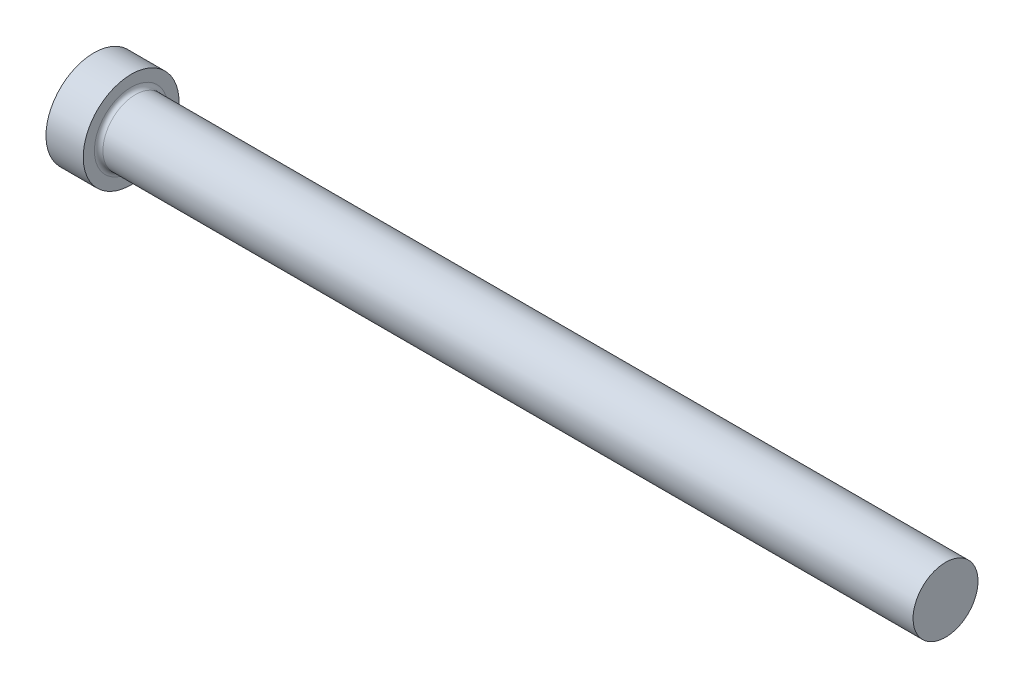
ISO-10303-21;
HEADER;
FILE_DESCRIPTION(('STEP AP214'),'2;1');
FILE_NAME('part.step','',(''),(''),'','','');
FILE_SCHEMA(('AUTOMOTIVE_DESIGN { 1 0 10303 214 1 1 1 1 }'));
ENDSEC;
DATA;
#1=APPLICATION_CONTEXT('core data for automotive mechanical design processes');
#2=APPLICATION_PROTOCOL_DEFINITION('international standard','automotive_design',2000,#1);
#3=PRODUCT_CONTEXT('',#1,'mechanical');
#4=PRODUCT('Part','Part','',(#3));
#5=PRODUCT_RELATED_PRODUCT_CATEGORY('part','',(#4));
#6=PRODUCT_DEFINITION_FORMATION('','',#4);
#7=PRODUCT_DEFINITION_CONTEXT('part definition',#1,'design');
#8=PRODUCT_DEFINITION('design','',#6,#7);
#9=PRODUCT_DEFINITION_SHAPE('','',#8);
#10=(LENGTH_UNIT() NAMED_UNIT(*) SI_UNIT(.MILLI.,.METRE.));
#11=(NAMED_UNIT(*) PLANE_ANGLE_UNIT() SI_UNIT($,.RADIAN.));
#12=(NAMED_UNIT(*) SI_UNIT($,.STERADIAN.) SOLID_ANGLE_UNIT());
#13=UNCERTAINTY_MEASURE_WITH_UNIT(LENGTH_MEASURE(1.E-05),#10,'distance_accuracy_value','');
#14=(GEOMETRIC_REPRESENTATION_CONTEXT(3) GLOBAL_UNCERTAINTY_ASSIGNED_CONTEXT((#13)) GLOBAL_UNIT_ASSIGNED_CONTEXT((#10,
#11,#12)) REPRESENTATION_CONTEXT('',''));
#15=CARTESIAN_POINT('',(0.,0.,0.));
#16=DIRECTION('',(0.,0.,1.));
#17=DIRECTION('',(1.,0.,0.));
#18=AXIS2_PLACEMENT_3D('',#15,#16,#17);
#19=CARTESIAN_POINT('',(0.,0.,0.));
#20=DIRECTION('',(-1.,0.,0.));
#21=DIRECTION('',(0.,-1.,0.));
#22=AXIS2_PLACEMENT_3D('',#19,#20,#21);
#23=PLANE('',#22);
#24=CARTESIAN_POINT('',(0.,0.,0.));
#25=DIRECTION('',(1.,0.,0.));
#26=DIRECTION('',(0.,1.,0.));
#27=AXIS2_PLACEMENT_3D('',#24,#25,#26);
#28=CIRCLE('',#27,9.);
#29=CARTESIAN_POINT('',(0.,9.,0.));
#30=VERTEX_POINT('',#29);
#31=EDGE_CURVE('E24',#30,#30,#28,.T.);
#32=ORIENTED_EDGE('',*,*,#31,.F.);
#33=EDGE_LOOP('',(#32));
#34=FACE_BOUND('',#33,.T.);
#35=ADVANCED_FACE('F13',(#34),#23,.T.);
#36=CARTESIAN_POINT('',(160.,0.,0.));
#37=DIRECTION('',(1.,0.,0.));
#38=DIRECTION('',(0.,1.,0.));
#39=AXIS2_PLACEMENT_3D('',#36,#37,#38);
#40=CYLINDRICAL_SURFACE('',#39,9.);
#41=ORIENTED_EDGE('',*,*,#31,.T.);
#42=EDGE_LOOP('',(#41));
#43=FACE_BOUND('',#42,.T.);
#44=CARTESIAN_POINT('',(7.,0.,0.));
#45=DIRECTION('',(1.,0.,0.));
#46=DIRECTION('',(0.,1.,0.));
#47=AXIS2_PLACEMENT_3D('',#44,#45,#46);
#48=CIRCLE('',#47,9.);
#49=CARTESIAN_POINT('',(7.,9.,0.));
#50=VERTEX_POINT('',#49);
#51=EDGE_CURVE('E28',#50,#50,#48,.T.);
#52=ORIENTED_EDGE('',*,*,#51,.F.);
#53=EDGE_LOOP('',(#52));
#54=FACE_BOUND('',#53,.T.);
#55=ADVANCED_FACE('F50',(#43,#54),#40,.T.);
#56=CARTESIAN_POINT('',(7.,9.,0.));
#57=DIRECTION('',(1.,0.,0.));
#58=DIRECTION('',(0.,1.,0.));
#59=AXIS2_PLACEMENT_3D('',#56,#57,#58);
#60=PLANE('',#59);
#61=CARTESIAN_POINT('',(7.,0.,0.));
#62=DIRECTION('',(1.,0.,0.));
#63=DIRECTION('',(0.,1.,0.));
#64=AXIS2_PLACEMENT_3D('',#61,#62,#63);
#65=CIRCLE('',#64,6.9);
#66=CARTESIAN_POINT('',(7.,6.9,0.));
#67=VERTEX_POINT('',#66);
#68=EDGE_CURVE('E8',#67,#67,#65,.F.);
#69=ORIENTED_EDGE('',*,*,#68,.T.);
#70=EDGE_LOOP('',(#69));
#71=FACE_BOUND('',#70,.T.);
#72=ORIENTED_EDGE('',*,*,#51,.T.);
#73=EDGE_LOOP('',(#72));
#74=FACE_BOUND('',#73,.T.);
#75=ADVANCED_FACE('F41',(#71,#74),#60,.T.);
#76=CARTESIAN_POINT('',(160.,0.,0.));
#77=DIRECTION('',(1.,0.,0.));
#78=DIRECTION('',(0.,1.,0.));
#79=AXIS2_PLACEMENT_3D('',#76,#77,#78);
#80=CYLINDRICAL_SURFACE('',#79,6.1);
#81=CARTESIAN_POINT('',(7.8,0.,0.));
#82=DIRECTION('',(1.,0.,0.));
#83=DIRECTION('',(0.,1.,0.));
#84=AXIS2_PLACEMENT_3D('',#81,#82,#83);
#85=CIRCLE('',#84,6.1);
#86=CARTESIAN_POINT('',(7.8,6.1,0.));
#87=VERTEX_POINT('',#86);
#88=EDGE_CURVE('E20',#87,#87,#85,.T.);
#89=ORIENTED_EDGE('',*,*,#88,.T.);
#90=EDGE_LOOP('',(#89));
#91=FACE_BOUND('',#90,.T.);
#92=CARTESIAN_POINT('',(160.,0.,0.));
#93=DIRECTION('',(1.,0.,0.));
#94=DIRECTION('',(0.,1.,0.));
#95=AXIS2_PLACEMENT_3D('',#92,#93,#94);
#96=CIRCLE('',#95,6.1);
#97=CARTESIAN_POINT('',(160.,6.1,0.));
#98=VERTEX_POINT('',#97);
#99=EDGE_CURVE('E33',#98,#98,#96,.T.);
#100=ORIENTED_EDGE('',*,*,#99,.F.);
#101=EDGE_LOOP('',(#100));
#102=FACE_BOUND('',#101,.T.);
#103=ADVANCED_FACE('F39',(#91,#102),#80,.T.);
#104=CARTESIAN_POINT('',(160.,6.1,0.));
#105=DIRECTION('',(1.,0.,0.));
#106=DIRECTION('',(0.,1.,0.));
#107=AXIS2_PLACEMENT_3D('',#104,#105,#106);
#108=PLANE('',#107);
#109=ORIENTED_EDGE('',*,*,#99,.T.);
#110=EDGE_LOOP('',(#109));
#111=FACE_BOUND('',#110,.T.);
#112=ADVANCED_FACE('F37',(#111),#108,.T.);
#113=CARTESIAN_POINT('',(7.8,0.,0.));
#114=DIRECTION('',(1.,0.,0.));
#115=DIRECTION('',(0.,1.,0.));
#116=AXIS2_PLACEMENT_3D('',#113,#114,#115);
#117=TOROIDAL_SURFACE('',#116,6.9,0.8);
#118=ORIENTED_EDGE('',*,*,#68,.F.);
#119=EDGE_LOOP('',(#118));
#120=FACE_BOUND('',#119,.T.);
#121=ORIENTED_EDGE('',*,*,#88,.F.);
#122=EDGE_LOOP('',(#121));
#123=FACE_BOUND('',#122,.T.);
#124=ADVANCED_FACE('F15',(#120,#123),#117,.F.);
#125=CLOSED_SHELL('',(#35,#55,#75,#103,#112,#124));
#126=MANIFOLD_SOLID_BREP('B1',#125);
#127=ADVANCED_BREP_SHAPE_REPRESENTATION('',(#18,#126),#14);
#128=SHAPE_DEFINITION_REPRESENTATION(#9,#127);
ENDSEC;
END-ISO-10303-21;
